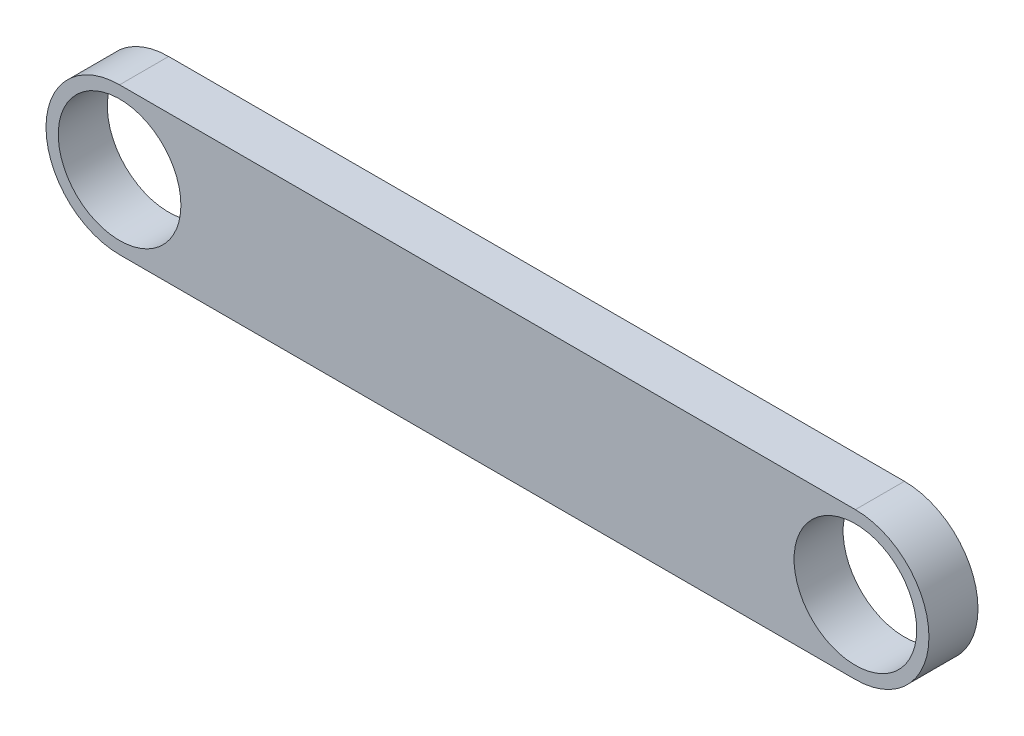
ISO-10303-21;
HEADER;
FILE_DESCRIPTION(('STEP AP214'),'2;1');
FILE_NAME('part.step','',(''),(''),'','','');
FILE_SCHEMA(('AUTOMOTIVE_DESIGN { 1 0 10303 214 1 1 1 1 }'));
ENDSEC;
DATA;
#1=APPLICATION_CONTEXT('core data for automotive mechanical design processes');
#2=APPLICATION_PROTOCOL_DEFINITION('international standard','automotive_design',2000,#1);
#3=PRODUCT_CONTEXT('',#1,'mechanical');
#4=PRODUCT('Part','Part','',(#3));
#5=PRODUCT_RELATED_PRODUCT_CATEGORY('part','',(#4));
#6=PRODUCT_DEFINITION_FORMATION('','',#4);
#7=PRODUCT_DEFINITION_CONTEXT('part definition',#1,'design');
#8=PRODUCT_DEFINITION('design','',#6,#7);
#9=PRODUCT_DEFINITION_SHAPE('','',#8);
#10=(LENGTH_UNIT() NAMED_UNIT(*) SI_UNIT(.MILLI.,.METRE.));
#11=(NAMED_UNIT(*) PLANE_ANGLE_UNIT() SI_UNIT($,.RADIAN.));
#12=(NAMED_UNIT(*) SI_UNIT($,.STERADIAN.) SOLID_ANGLE_UNIT());
#13=UNCERTAINTY_MEASURE_WITH_UNIT(LENGTH_MEASURE(1.E-05),#10,'distance_accuracy_value','');
#14=(GEOMETRIC_REPRESENTATION_CONTEXT(3) GLOBAL_UNCERTAINTY_ASSIGNED_CONTEXT((#13)) GLOBAL_UNIT_ASSIGNED_CONTEXT((#10,
#11,#12)) REPRESENTATION_CONTEXT('',''));
#15=CARTESIAN_POINT('',(0.,0.,0.));
#16=DIRECTION('',(0.,0.,1.));
#17=DIRECTION('',(1.,0.,0.));
#18=AXIS2_PLACEMENT_3D('',#15,#16,#17);
#19=CARTESIAN_POINT('',(0.,0.,10.));
#20=DIRECTION('',(0.,0.,1.));
#21=DIRECTION('',(1.,0.,0.));
#22=AXIS2_PLACEMENT_3D('',#19,#20,#21);
#23=PLANE('',#22);
#24=CARTESIAN_POINT('',(0.,0.,10.));
#25=DIRECTION('',(0.,0.,1.));
#26=DIRECTION('',(1.,0.,0.));
#27=AXIS2_PLACEMENT_3D('',#24,#25,#26);
#28=CIRCLE('',#27,12.5);
#29=CARTESIAN_POINT('',(12.5,0.,10.));
#30=VERTEX_POINT('',#29);
#31=EDGE_CURVE('E100',#30,#30,#28,.T.);
#32=ORIENTED_EDGE('',*,*,#31,.F.);
#33=EDGE_LOOP('',(#32));
#34=FACE_BOUND('',#33,.T.);
#35=CARTESIAN_POINT('',(0.,0.,10.));
#36=DIRECTION('',(0.,0.,1.));
#37=DIRECTION('',(1.,0.,0.));
#38=AXIS2_PLACEMENT_3D('',#35,#36,#37);
#39=CIRCLE('',#38,15.);
#40=CARTESIAN_POINT('',(0.,15.,10.));
#41=VERTEX_POINT('',#40);
#42=CARTESIAN_POINT('',(0.,-15.,10.));
#43=VERTEX_POINT('',#42);
#44=EDGE_CURVE('E85',#41,#43,#39,.T.);
#45=ORIENTED_EDGE('',*,*,#44,.T.);
#46=DIRECTION('',(1.,0.,0.));
#47=VECTOR('',#46,1.);
#48=CARTESIAN_POINT('',(0.,-15.,10.));
#49=LINE('',#48,#47);
#50=CARTESIAN_POINT('',(150.,-15.,10.));
#51=VERTEX_POINT('',#50);
#52=EDGE_CURVE('E80',#43,#51,#49,.T.);
#53=ORIENTED_EDGE('',*,*,#52,.T.);
#54=CARTESIAN_POINT('',(150.,0.,10.));
#55=DIRECTION('',(0.,0.,1.));
#56=DIRECTION('',(1.,0.,0.));
#57=AXIS2_PLACEMENT_3D('',#54,#55,#56);
#58=CIRCLE('',#57,15.);
#59=CARTESIAN_POINT('',(150.,15.,10.));
#60=VERTEX_POINT('',#59);
#61=EDGE_CURVE('E83',#51,#60,#58,.T.);
#62=ORIENTED_EDGE('',*,*,#61,.T.);
#63=DIRECTION('',(-1.,0.,0.));
#64=VECTOR('',#63,1.);
#65=CARTESIAN_POINT('',(0.,15.,10.));
#66=LINE('',#65,#64);
#67=EDGE_CURVE('E50',#60,#41,#66,.T.);
#68=ORIENTED_EDGE('',*,*,#67,.T.);
#69=EDGE_LOOP('',(#45,#53,#62,#68));
#70=FACE_BOUND('',#69,.T.);
#71=CARTESIAN_POINT('',(150.,0.,10.));
#72=DIRECTION('',(0.,0.,1.));
#73=DIRECTION('',(1.,0.,0.));
#74=AXIS2_PLACEMENT_3D('',#71,#72,#73);
#75=CIRCLE('',#74,12.5);
#76=CARTESIAN_POINT('',(162.5,0.,10.));
#77=VERTEX_POINT('',#76);
#78=EDGE_CURVE('E115',#77,#77,#75,.T.);
#79=ORIENTED_EDGE('',*,*,#78,.F.);
#80=EDGE_LOOP('',(#79));
#81=FACE_BOUND('',#80,.T.);
#82=ADVANCED_FACE('F33',(#34,#70,#81),#23,.T.);
#83=CARTESIAN_POINT('',(0.,0.,0.));
#84=DIRECTION('',(0.,0.,1.));
#85=DIRECTION('',(1.,0.,0.));
#86=AXIS2_PLACEMENT_3D('',#83,#84,#85);
#87=PLANE('',#86);
#88=CARTESIAN_POINT('',(0.,0.,0.));
#89=DIRECTION('',(0.,0.,1.));
#90=DIRECTION('',(1.,0.,0.));
#91=AXIS2_PLACEMENT_3D('',#88,#89,#90);
#92=CIRCLE('',#91,15.);
#93=CARTESIAN_POINT('',(0.,15.,0.));
#94=VERTEX_POINT('',#93);
#95=CARTESIAN_POINT('',(0.,-15.,0.));
#96=VERTEX_POINT('',#95);
#97=EDGE_CURVE('E97',#94,#96,#92,.T.);
#98=ORIENTED_EDGE('',*,*,#97,.F.);
#99=DIRECTION('',(-1.,0.,0.));
#100=VECTOR('',#99,1.);
#101=CARTESIAN_POINT('',(0.,15.,0.));
#102=LINE('',#101,#100);
#103=CARTESIAN_POINT('',(150.,15.,0.));
#104=VERTEX_POINT('',#103);
#105=EDGE_CURVE('E73',#104,#94,#102,.T.);
#106=ORIENTED_EDGE('',*,*,#105,.F.);
#107=CARTESIAN_POINT('',(150.,0.,0.));
#108=DIRECTION('',(0.,0.,1.));
#109=DIRECTION('',(1.,0.,0.));
#110=AXIS2_PLACEMENT_3D('',#107,#108,#109);
#111=CIRCLE('',#110,15.);
#112=CARTESIAN_POINT('',(150.,-15.,0.));
#113=VERTEX_POINT('',#112);
#114=EDGE_CURVE('E67',#113,#104,#111,.T.);
#115=ORIENTED_EDGE('',*,*,#114,.F.);
#116=DIRECTION('',(1.,0.,0.));
#117=VECTOR('',#116,1.);
#118=CARTESIAN_POINT('',(0.,-15.,0.));
#119=LINE('',#118,#117);
#120=EDGE_CURVE('E89',#96,#113,#119,.T.);
#121=ORIENTED_EDGE('',*,*,#120,.F.);
#122=EDGE_LOOP('',(#98,#106,#115,#121));
#123=FACE_BOUND('',#122,.T.);
#124=CARTESIAN_POINT('',(0.,0.,0.));
#125=DIRECTION('',(0.,0.,1.));
#126=DIRECTION('',(1.,0.,0.));
#127=AXIS2_PLACEMENT_3D('',#124,#125,#126);
#128=CIRCLE('',#127,12.5);
#129=CARTESIAN_POINT('',(12.5,0.,0.));
#130=VERTEX_POINT('',#129);
#131=EDGE_CURVE('E112',#130,#130,#128,.T.);
#132=ORIENTED_EDGE('',*,*,#131,.T.);
#133=EDGE_LOOP('',(#132));
#134=FACE_BOUND('',#133,.T.);
#135=CARTESIAN_POINT('',(150.,0.,0.));
#136=DIRECTION('',(0.,0.,1.));
#137=DIRECTION('',(1.,0.,0.));
#138=AXIS2_PLACEMENT_3D('',#135,#136,#137);
#139=CIRCLE('',#138,12.5);
#140=CARTESIAN_POINT('',(162.5,0.,0.));
#141=VERTEX_POINT('',#140);
#142=EDGE_CURVE('E118',#141,#141,#139,.T.);
#143=ORIENTED_EDGE('',*,*,#142,.T.);
#144=EDGE_LOOP('',(#143));
#145=FACE_BOUND('',#144,.T.);
#146=ADVANCED_FACE('F108',(#123,#134,#145),#87,.F.);
#147=CARTESIAN_POINT('',(0.,0.,10.));
#148=DIRECTION('',(0.,0.,-1.));
#149=DIRECTION('',(-1.,0.,0.));
#150=AXIS2_PLACEMENT_3D('',#147,#148,#149);
#151=CYLINDRICAL_SURFACE('',#150,15.);
#152=ORIENTED_EDGE('',*,*,#97,.T.);
#153=DIRECTION('',(0.,0.,-1.));
#154=VECTOR('',#153,1.);
#155=CARTESIAN_POINT('',(0.,-15.,10.));
#156=LINE('',#155,#154);
#157=EDGE_CURVE('E11',#43,#96,#156,.T.);
#158=ORIENTED_EDGE('',*,*,#157,.F.);
#159=ORIENTED_EDGE('',*,*,#44,.F.);
#160=DIRECTION('',(0.,0.,-1.));
#161=VECTOR('',#160,1.);
#162=CARTESIAN_POINT('',(0.,15.,10.));
#163=LINE('',#162,#161);
#164=EDGE_CURVE('E93',#41,#94,#163,.T.);
#165=ORIENTED_EDGE('',*,*,#164,.T.);
#166=EDGE_LOOP('',(#152,#158,#159,#165));
#167=FACE_BOUND('',#166,.T.);
#168=ADVANCED_FACE('F35',(#167),#151,.T.);
#169=CARTESIAN_POINT('',(0.,-15.,10.));
#170=DIRECTION('',(0.,1.,0.));
#171=DIRECTION('',(0.,0.,1.));
#172=AXIS2_PLACEMENT_3D('',#169,#170,#171);
#173=PLANE('',#172);
#174=ORIENTED_EDGE('',*,*,#120,.T.);
#175=DIRECTION('',(0.,0.,-1.));
#176=VECTOR('',#175,1.);
#177=CARTESIAN_POINT('',(150.,-15.,10.));
#178=LINE('',#177,#176);
#179=EDGE_CURVE('E42',#51,#113,#178,.T.);
#180=ORIENTED_EDGE('',*,*,#179,.F.);
#181=ORIENTED_EDGE('',*,*,#52,.F.);
#182=ORIENTED_EDGE('',*,*,#157,.T.);
#183=EDGE_LOOP('',(#174,#180,#181,#182));
#184=FACE_BOUND('',#183,.T.);
#185=ADVANCED_FACE('F88',(#184),#173,.F.);
#186=CARTESIAN_POINT('',(150.,0.,10.));
#187=DIRECTION('',(0.,0.,-1.));
#188=DIRECTION('',(-1.,0.,0.));
#189=AXIS2_PLACEMENT_3D('',#186,#187,#188);
#190=CYLINDRICAL_SURFACE('',#189,15.);
#191=ORIENTED_EDGE('',*,*,#114,.T.);
#192=DIRECTION('',(0.,0.,-1.));
#193=VECTOR('',#192,1.);
#194=CARTESIAN_POINT('',(150.,15.,10.));
#195=LINE('',#194,#193);
#196=EDGE_CURVE('E90',#60,#104,#195,.T.);
#197=ORIENTED_EDGE('',*,*,#196,.F.);
#198=ORIENTED_EDGE('',*,*,#61,.F.);
#199=ORIENTED_EDGE('',*,*,#179,.T.);
#200=EDGE_LOOP('',(#191,#197,#198,#199));
#201=FACE_BOUND('',#200,.T.);
#202=ADVANCED_FACE('F91',(#201),#190,.T.);
#203=CARTESIAN_POINT('',(0.,15.,10.));
#204=DIRECTION('',(0.,-1.,0.));
#205=DIRECTION('',(0.,0.,-1.));
#206=AXIS2_PLACEMENT_3D('',#203,#204,#205);
#207=PLANE('',#206);
#208=ORIENTED_EDGE('',*,*,#105,.T.);
#209=ORIENTED_EDGE('',*,*,#164,.F.);
#210=ORIENTED_EDGE('',*,*,#67,.F.);
#211=ORIENTED_EDGE('',*,*,#196,.T.);
#212=EDGE_LOOP('',(#208,#209,#210,#211));
#213=FACE_BOUND('',#212,.T.);
#214=ADVANCED_FACE('F105',(#213),#207,.F.);
#215=CARTESIAN_POINT('',(0.,0.,10.));
#216=DIRECTION('',(0.,0.,-1.));
#217=DIRECTION('',(-1.,0.,0.));
#218=AXIS2_PLACEMENT_3D('',#215,#216,#217);
#219=CYLINDRICAL_SURFACE('',#218,12.5);
#220=ORIENTED_EDGE('',*,*,#31,.T.);
#221=EDGE_LOOP('',(#220));
#222=FACE_BOUND('',#221,.T.);
#223=ORIENTED_EDGE('',*,*,#131,.F.);
#224=EDGE_LOOP('',(#223));
#225=FACE_BOUND('',#224,.T.);
#226=ADVANCED_FACE('F135',(#222,#225),#219,.F.);
#227=CARTESIAN_POINT('',(150.,0.,10.));
#228=DIRECTION('',(0.,0.,-1.));
#229=DIRECTION('',(-1.,0.,0.));
#230=AXIS2_PLACEMENT_3D('',#227,#228,#229);
#231=CYLINDRICAL_SURFACE('',#230,12.5);
#232=ORIENTED_EDGE('',*,*,#78,.T.);
#233=EDGE_LOOP('',(#232));
#234=FACE_BOUND('',#233,.T.);
#235=ORIENTED_EDGE('',*,*,#142,.F.);
#236=EDGE_LOOP('',(#235));
#237=FACE_BOUND('',#236,.T.);
#238=ADVANCED_FACE('F124',(#234,#237),#231,.F.);
#239=CLOSED_SHELL('',(#82,#146,#168,#185,#202,#214,#226,#238));
#240=MANIFOLD_SOLID_BREP('B2',#239);
#241=ADVANCED_BREP_SHAPE_REPRESENTATION('',(#18,#240),#14);
#242=SHAPE_DEFINITION_REPRESENTATION(#9,#241);
ENDSEC;
END-ISO-10303-21;
